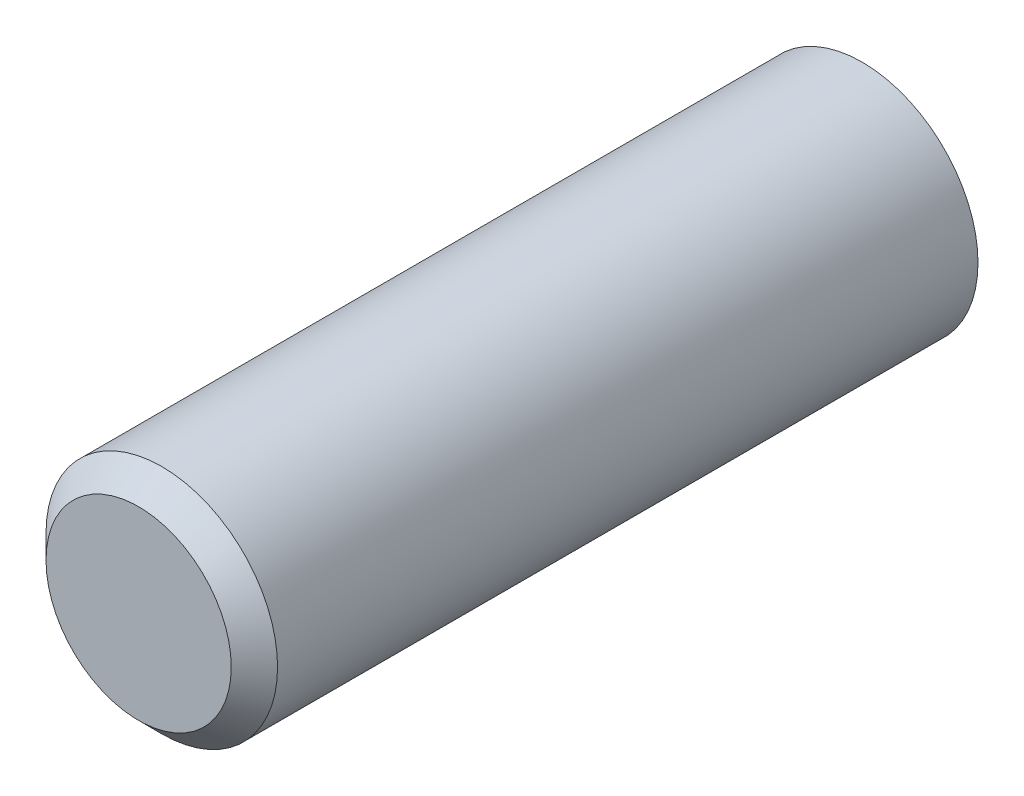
ISO-10303-21;
HEADER;
FILE_DESCRIPTION(('STEP AP214'),'2;1');
FILE_NAME('part.step','',(''),(''),'','','');
FILE_SCHEMA(('AUTOMOTIVE_DESIGN { 1 0 10303 214 1 1 1 1 }'));
ENDSEC;
DATA;
#1=APPLICATION_CONTEXT('core data for automotive mechanical design processes');
#2=APPLICATION_PROTOCOL_DEFINITION('international standard','automotive_design',2000,#1);
#3=PRODUCT_CONTEXT('',#1,'mechanical');
#4=PRODUCT('Part','Part','',(#3));
#5=PRODUCT_RELATED_PRODUCT_CATEGORY('part','',(#4));
#6=PRODUCT_DEFINITION_FORMATION('','',#4);
#7=PRODUCT_DEFINITION_CONTEXT('part definition',#1,'design');
#8=PRODUCT_DEFINITION('design','',#6,#7);
#9=PRODUCT_DEFINITION_SHAPE('','',#8);
#10=(LENGTH_UNIT() NAMED_UNIT(*) SI_UNIT(.MILLI.,.METRE.));
#11=(NAMED_UNIT(*) PLANE_ANGLE_UNIT() SI_UNIT($,.RADIAN.));
#12=(NAMED_UNIT(*) SI_UNIT($,.STERADIAN.) SOLID_ANGLE_UNIT());
#13=UNCERTAINTY_MEASURE_WITH_UNIT(LENGTH_MEASURE(1.E-05),#10,'distance_accuracy_value','');
#14=(GEOMETRIC_REPRESENTATION_CONTEXT(3) GLOBAL_UNCERTAINTY_ASSIGNED_CONTEXT((#13)) GLOBAL_UNIT_ASSIGNED_CONTEXT((#10,
#11,#12)) REPRESENTATION_CONTEXT('',''));
#15=CARTESIAN_POINT('',(0.,0.,0.));
#16=DIRECTION('',(0.,0.,1.));
#17=DIRECTION('',(1.,0.,0.));
#18=AXIS2_PLACEMENT_3D('',#15,#16,#17);
#19=CARTESIAN_POINT('',(0.,0.,25.));
#20=DIRECTION('',(0.,0.,-1.));
#21=DIRECTION('',(-1.,0.,0.));
#22=AXIS2_PLACEMENT_3D('',#19,#20,#21);
#23=CYLINDRICAL_SURFACE('',#22,8.);
#24=CARTESIAN_POINT('',(0.,0.,23.4));
#25=DIRECTION('',(0.,0.,1.));
#26=DIRECTION('',(1.,0.,0.));
#27=AXIS2_PLACEMENT_3D('',#24,#25,#26);
#28=CIRCLE('',#27,8.);
#29=CARTESIAN_POINT('',(8.,0.,23.4));
#30=VERTEX_POINT('',#29);
#31=EDGE_CURVE('E10',#30,#30,#28,.F.);
#32=ORIENTED_EDGE('',*,*,#31,.T.);
#33=EDGE_LOOP('',(#32));
#34=FACE_BOUND('',#33,.T.);
#35=CARTESIAN_POINT('',(0.,0.,-25.));
#36=DIRECTION('',(0.,0.,1.));
#37=DIRECTION('',(1.,0.,0.));
#38=AXIS2_PLACEMENT_3D('',#35,#36,#37);
#39=CIRCLE('',#38,8.);
#40=CARTESIAN_POINT('',(8.,0.,-25.));
#41=VERTEX_POINT('',#40);
#42=EDGE_CURVE('E41',#41,#41,#39,.T.);
#43=ORIENTED_EDGE('',*,*,#42,.T.);
#44=EDGE_LOOP('',(#43));
#45=FACE_BOUND('',#44,.T.);
#46=ADVANCED_FACE('F30',(#34,#45),#23,.T.);
#47=CARTESIAN_POINT('',(0.,0.,25.));
#48=DIRECTION('',(0.,0.,1.));
#49=DIRECTION('',(1.,0.,0.));
#50=AXIS2_PLACEMENT_3D('',#47,#48,#49);
#51=PLANE('',#50);
#52=CARTESIAN_POINT('',(0.,0.,25.));
#53=DIRECTION('',(0.,0.,1.));
#54=DIRECTION('',(1.,0.,0.));
#55=AXIS2_PLACEMENT_3D('',#52,#53,#54);
#56=CIRCLE('',#55,6.4);
#57=CARTESIAN_POINT('',(6.4,0.,25.));
#58=VERTEX_POINT('',#57);
#59=EDGE_CURVE('E37',#58,#58,#56,.T.);
#60=ORIENTED_EDGE('',*,*,#59,.T.);
#61=EDGE_LOOP('',(#60));
#62=FACE_BOUND('',#61,.T.);
#63=ADVANCED_FACE('F51',(#62),#51,.T.);
#64=CARTESIAN_POINT('',(0.,0.,-25.));
#65=DIRECTION('',(0.,0.,1.));
#66=DIRECTION('',(1.,0.,0.));
#67=AXIS2_PLACEMENT_3D('',#64,#65,#66);
#68=PLANE('',#67);
#69=ORIENTED_EDGE('',*,*,#42,.F.);
#70=EDGE_LOOP('',(#69));
#71=FACE_BOUND('',#70,.T.);
#72=ADVANCED_FACE('F49',(#71),#68,.F.);
#73=CARTESIAN_POINT('',(0.,0.,25.));
#74=DIRECTION('',(0.,0.,-1.));
#75=DIRECTION('',(-1.,0.,0.));
#76=AXIS2_PLACEMENT_3D('',#73,#74,#75);
#77=CONICAL_SURFACE('',#76,6.4,0.785398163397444);
#78=ORIENTED_EDGE('',*,*,#31,.F.);
#79=EDGE_LOOP('',(#78));
#80=FACE_BOUND('',#79,.T.);
#81=ORIENTED_EDGE('',*,*,#59,.F.);
#82=EDGE_LOOP('',(#81));
#83=FACE_BOUND('',#82,.T.);
#84=ADVANCED_FACE('F32',(#80,#83),#77,.T.);
#85=CLOSED_SHELL('',(#46,#63,#72,#84));
#86=MANIFOLD_SOLID_BREP('B2',#85);
#87=ADVANCED_BREP_SHAPE_REPRESENTATION('',(#18,#86),#14);
#88=SHAPE_DEFINITION_REPRESENTATION(#9,#87);
ENDSEC;
END-ISO-10303-21;
